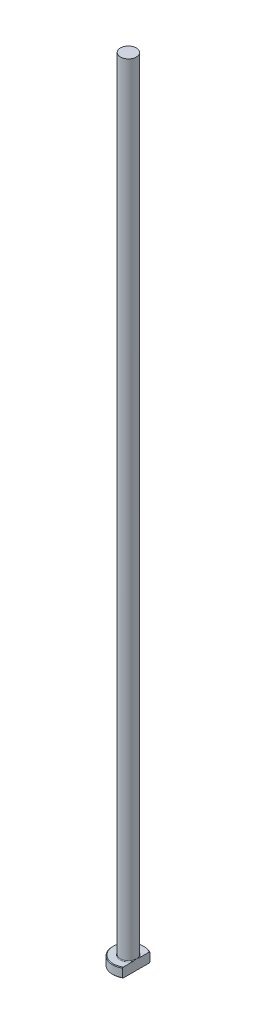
ISO-10303-21;
HEADER;
FILE_DESCRIPTION(('STEP AP214'),'2;1');
FILE_NAME('part.step','',(''),(''),'','','');
FILE_SCHEMA(('AUTOMOTIVE_DESIGN { 1 0 10303 214 1 1 1 1 }'));
ENDSEC;
DATA;
#1=APPLICATION_CONTEXT('core data for automotive mechanical design processes');
#2=APPLICATION_PROTOCOL_DEFINITION('international standard','automotive_design',2000,#1);
#3=PRODUCT_CONTEXT('',#1,'mechanical');
#4=PRODUCT('Part','Part','',(#3));
#5=PRODUCT_RELATED_PRODUCT_CATEGORY('part','',(#4));
#6=PRODUCT_DEFINITION_FORMATION('','',#4);
#7=PRODUCT_DEFINITION_CONTEXT('part definition',#1,'design');
#8=PRODUCT_DEFINITION('design','',#6,#7);
#9=PRODUCT_DEFINITION_SHAPE('','',#8);
#10=(LENGTH_UNIT() NAMED_UNIT(*) SI_UNIT(.MILLI.,.METRE.));
#11=(NAMED_UNIT(*) PLANE_ANGLE_UNIT() SI_UNIT($,.RADIAN.));
#12=(NAMED_UNIT(*) SI_UNIT($,.STERADIAN.) SOLID_ANGLE_UNIT());
#13=UNCERTAINTY_MEASURE_WITH_UNIT(LENGTH_MEASURE(1.E-05),#10,'distance_accuracy_value','');
#14=(GEOMETRIC_REPRESENTATION_CONTEXT(3) GLOBAL_UNCERTAINTY_ASSIGNED_CONTEXT((#13)) GLOBAL_UNIT_ASSIGNED_CONTEXT((#10,
#11,#12)) REPRESENTATION_CONTEXT('',''));
#15=CARTESIAN_POINT('',(0.,0.,0.));
#16=DIRECTION('',(0.,0.,1.));
#17=DIRECTION('',(1.,0.,0.));
#18=AXIS2_PLACEMENT_3D('',#15,#16,#17);
#19=CARTESIAN_POINT('',(0.,0.,0.));
#20=DIRECTION('',(0.,-1.,0.));
#21=DIRECTION('',(0.,0.,-1.));
#22=AXIS2_PLACEMENT_3D('',#19,#20,#21);
#23=PLANE('',#22);
#24=CARTESIAN_POINT('',(0.,0.,0.));
#25=DIRECTION('',(0.,-1.,0.));
#26=DIRECTION('',(0.,0.,-1.));
#27=AXIS2_PLACEMENT_3D('',#24,#25,#26);
#28=CIRCLE('',#27,4.79999999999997);
#29=CARTESIAN_POINT('',(2.49999999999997,0.,4.09756024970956));
#30=VERTEX_POINT('',#29);
#31=CARTESIAN_POINT('',(2.49999999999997,0.,-4.09756024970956));
#32=VERTEX_POINT('',#31);
#33=EDGE_CURVE('E98',#30,#32,#28,.T.);
#34=ORIENTED_EDGE('',*,*,#33,.T.);
#35=DIRECTION('',(0.,0.,1.));
#36=VECTOR('',#35,1.);
#37=CARTESIAN_POINT('',(2.49999999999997,0.,-4.33012701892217));
#38=LINE('',#37,#36);
#39=EDGE_CURVE('E83',#32,#30,#38,.T.);
#40=ORIENTED_EDGE('',*,*,#39,.T.);
#41=EDGE_LOOP('',(#34,#40));
#42=FACE_BOUND('',#41,.T.);
#43=ADVANCED_FACE('F32',(#42),#23,.T.);
#44=CARTESIAN_POINT('',(0.,259.958771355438,0.));
#45=DIRECTION('',(0.,1.,0.));
#46=DIRECTION('',(0.,0.,1.));
#47=AXIS2_PLACEMENT_3D('',#44,#45,#46);
#48=CYLINDRICAL_SURFACE('',#47,4.99999999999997);
#49=CARTESIAN_POINT('',(0.,2.79999999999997,0.));
#50=DIRECTION('',(0.,1.,0.));
#51=DIRECTION('',(0.,0.,1.));
#52=AXIS2_PLACEMENT_3D('',#49,#50,#51);
#53=CIRCLE('',#52,4.99999999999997);
#54=CARTESIAN_POINT('',(2.49999999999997,2.79999999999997,4.33012701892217));
#55=VERTEX_POINT('',#54);
#56=CARTESIAN_POINT('',(2.49999999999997,2.79999999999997,-4.33012701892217));
#57=VERTEX_POINT('',#56);
#58=EDGE_CURVE('E104',#55,#57,#53,.F.);
#59=ORIENTED_EDGE('',*,*,#58,.T.);
#60=DIRECTION('',(0.,-1.,0.));
#61=VECTOR('',#60,1.);
#62=CARTESIAN_POINT('',(2.49999999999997,250.,-4.33012701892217));
#63=LINE('',#62,#61);
#64=CARTESIAN_POINT('',(2.49999999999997,0.200000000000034,-4.33012701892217));
#65=VERTEX_POINT('',#64);
#66=EDGE_CURVE('E183',#57,#65,#63,.T.);
#67=ORIENTED_EDGE('',*,*,#66,.T.);
#68=CARTESIAN_POINT('',(0.,0.200000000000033,0.));
#69=DIRECTION('',(0.,-1.,0.));
#70=DIRECTION('',(0.,0.,-1.));
#71=AXIS2_PLACEMENT_3D('',#68,#69,#70);
#72=CIRCLE('',#71,4.99999999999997);
#73=CARTESIAN_POINT('',(2.49999999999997,0.200000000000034,4.33012701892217));
#74=VERTEX_POINT('',#73);
#75=EDGE_CURVE('E100',#65,#74,#72,.F.);
#76=ORIENTED_EDGE('',*,*,#75,.T.);
#77=DIRECTION('',(0.,-1.,0.));
#78=VECTOR('',#77,1.);
#79=CARTESIAN_POINT('',(2.49999999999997,250.,4.33012701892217));
#80=LINE('',#79,#78);
#81=EDGE_CURVE('E93',#55,#74,#80,.T.);
#82=ORIENTED_EDGE('',*,*,#81,.F.);
#83=EDGE_LOOP('',(#59,#67,#76,#82));
#84=FACE_BOUND('',#83,.T.);
#85=ADVANCED_FACE('F158',(#84),#48,.T.);
#86=CARTESIAN_POINT('',(-4.99999999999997,3.,0.));
#87=DIRECTION('',(0.,1.,0.));
#88=DIRECTION('',(0.,0.,1.));
#89=AXIS2_PLACEMENT_3D('',#86,#87,#88);
#90=PLANE('',#89);
#91=CARTESIAN_POINT('',(0.,3.,0.));
#92=DIRECTION('',(0.,1.,0.));
#93=DIRECTION('',(0.,0.,1.));
#94=AXIS2_PLACEMENT_3D('',#91,#92,#93);
#95=CIRCLE('',#94,4.79999999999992);
#96=CARTESIAN_POINT('',(2.49999999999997,3.,-4.0975602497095));
#97=VERTEX_POINT('',#96);
#98=CARTESIAN_POINT('',(2.49999999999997,3.,4.0975602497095));
#99=VERTEX_POINT('',#98);
#100=EDGE_CURVE('E178',#97,#99,#95,.T.);
#101=ORIENTED_EDGE('',*,*,#100,.T.);
#102=DIRECTION('',(0.,0.,-1.));
#103=VECTOR('',#102,1.);
#104=CARTESIAN_POINT('',(2.49999999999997,3.,0.));
#105=LINE('',#104,#103);
#106=CARTESIAN_POINT('',(2.49999999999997,2.99999999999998,1.01980390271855));
#107=VERTEX_POINT('',#106);
#108=EDGE_CURVE('E57',#99,#107,#105,.T.);
#109=ORIENTED_EDGE('',*,*,#108,.T.);
#110=CARTESIAN_POINT('',(0.,3.,0.));
#111=DIRECTION('',(0.,1.,0.));
#112=DIRECTION('',(0.,0.,1.));
#113=AXIS2_PLACEMENT_3D('',#110,#111,#112);
#114=CIRCLE('',#113,2.69999999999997);
#115=CARTESIAN_POINT('',(2.49999999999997,2.99999999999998,-1.01980390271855));
#116=VERTEX_POINT('',#115);
#117=EDGE_CURVE('E107',#107,#116,#114,.F.);
#118=ORIENTED_EDGE('',*,*,#117,.T.);
#119=EDGE_CURVE('E136',#116,#97,#105,.T.);
#120=ORIENTED_EDGE('',*,*,#119,.T.);
#121=EDGE_LOOP('',(#101,#109,#118,#120));
#122=FACE_BOUND('',#121,.T.);
#123=ADVANCED_FACE('F147',(#122),#90,.T.);
#124=CARTESIAN_POINT('',(0.,3.,0.));
#125=DIRECTION('',(0.,-1.,0.));
#126=DIRECTION('',(0.,0.,-1.));
#127=AXIS2_PLACEMENT_3D('',#124,#125,#126);
#128=CONICAL_SURFACE('',#127,4.79999999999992,0.785398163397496);
#129=ORIENTED_EDGE('',*,*,#58,.F.);
#130=CARTESIAN_POINT('',(2.49999999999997,-2.05039133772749,9.52786489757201));
#131=CARTESIAN_POINT('',(2.49999999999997,-1.8416036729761,9.31199733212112));
#132=CARTESIAN_POINT('',(2.49999999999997,-1.63304008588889,9.09591231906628));
#133=CARTESIAN_POINT('',(2.49999999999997,-1.21649358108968,8.66317810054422));
#134=CARTESIAN_POINT('',(2.49999999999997,-1.0085106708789,8.44652888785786));
#135=CARTESIAN_POINT('',(2.49999999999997,-0.593157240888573,8.01243155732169));
#136=CARTESIAN_POINT('',(2.49999999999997,-0.385787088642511,7.79498308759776));
#137=CARTESIAN_POINT('',(2.49999999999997,0.0280365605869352,7.3592177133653));
#138=CARTESIAN_POINT('',(2.49999999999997,0.234490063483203,7.14090081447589));
#139=CARTESIAN_POINT('',(2.49999999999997,0.642130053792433,6.70748960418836));
#140=CARTESIAN_POINT('',(2.49999999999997,0.8433398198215,6.49241720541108));
#141=CARTESIAN_POINT('',(2.49999999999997,1.2442538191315,6.06087422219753));
#142=CARTESIAN_POINT('',(2.49999999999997,1.44395806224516,5.84440364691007));
#143=CARTESIAN_POINT('',(2.49999999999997,1.84127751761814,5.40963663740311));
#144=CARTESIAN_POINT('',(2.49999999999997,2.03889317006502,5.19134060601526));
#145=CARTESIAN_POINT('',(2.49999999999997,2.43125043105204,4.75218509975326));
#146=CARTESIAN_POINT('',(2.49999999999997,2.62599215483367,4.53132572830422));
#147=CARTESIAN_POINT('',(2.49999999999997,2.93693788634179,4.17181619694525));
#148=CARTESIAN_POINT('',(2.49999999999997,3.05446493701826,4.03431188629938));
#149=CARTESIAN_POINT('',(2.49999999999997,3.28742704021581,3.7575148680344));
#150=CARTESIAN_POINT('',(2.49999999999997,3.40286188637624,3.618221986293));
#151=CARTESIAN_POINT('',(2.49999999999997,3.632132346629,3.3358649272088));
#152=CARTESIAN_POINT('',(2.49999999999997,3.74593818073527,3.1927764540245));
#153=CARTESIAN_POINT('',(2.49999999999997,3.96956266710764,2.90356071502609));
#154=CARTESIAN_POINT('',(2.49999999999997,4.0793822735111,2.75743418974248));
#155=CARTESIAN_POINT('',(2.49999999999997,4.29502410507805,2.45881038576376));
#156=CARTESIAN_POINT('',(2.49999999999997,4.40076032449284,2.30625006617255));
#157=CARTESIAN_POINT('',(2.49999999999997,4.55286945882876,2.07299325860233));
#158=CARTESIAN_POINT('',(2.49999999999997,4.60252613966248,1.9944419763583));
#159=CARTESIAN_POINT('',(2.49999999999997,4.69908164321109,1.83566827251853));
#160=CARTESIAN_POINT('',(2.49999999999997,4.74598077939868,1.75544604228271));
#161=CARTESIAN_POINT('',(2.49999999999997,4.83578466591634,1.59405362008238));
#162=CARTESIAN_POINT('',(2.49999999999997,4.87873126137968,1.5129070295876));
#163=CARTESIAN_POINT('',(2.49999999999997,4.96038600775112,1.34852090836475));
#164=CARTESIAN_POINT('',(2.49999999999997,4.99909338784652,1.26528100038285));
#165=CARTESIAN_POINT('',(2.49999999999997,5.10703093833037,1.01251774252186));
#166=CARTESIAN_POINT('',(2.49999999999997,5.16843307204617,0.839342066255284));
#167=CARTESIAN_POINT('',(2.49999999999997,5.23490554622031,0.579703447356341));
#168=CARTESIAN_POINT('',(2.49999999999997,5.25253806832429,0.496421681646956));
#169=CARTESIAN_POINT('',(2.49999999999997,5.27986337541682,0.328535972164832));
#170=CARTESIAN_POINT('',(2.49999999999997,5.2895568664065,0.243932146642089));
#171=CARTESIAN_POINT('',(2.49999999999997,5.30031768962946,0.0744340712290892));
#172=CARTESIAN_POINT('',(2.49999999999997,5.30141176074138,-0.0104584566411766));
#173=CARTESIAN_POINT('',(2.49999999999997,5.29496530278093,-0.179916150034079));
#174=CARTESIAN_POINT('',(2.49999999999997,5.28742406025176,-0.264481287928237));
#175=CARTESIAN_POINT('',(2.49999999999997,5.26433424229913,-0.431754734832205));
#176=CARTESIAN_POINT('',(2.49999999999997,5.24885436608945,-0.514472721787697));
#177=CARTESIAN_POINT('',(2.49999999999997,5.21085318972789,-0.678257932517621));
#178=CARTESIAN_POINT('',(2.49999999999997,5.18833104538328,-0.759324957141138));
#179=CARTESIAN_POINT('',(2.49999999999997,5.13718929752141,-0.920001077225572));
#180=CARTESIAN_POINT('',(2.49999999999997,5.1085353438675,-0.999599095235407));
#181=CARTESIAN_POINT('',(2.49999999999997,5.04628092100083,-1.15679278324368));
#182=CARTESIAN_POINT('',(2.49999999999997,5.01268146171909,-1.23438885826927));
#183=CARTESIAN_POINT('',(2.49999999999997,4.90558195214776,-1.46503672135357));
#184=CARTESIAN_POINT('',(2.49999999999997,4.82601567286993,-1.61526350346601));
#185=CARTESIAN_POINT('',(2.49999999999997,4.65635232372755,-1.90970759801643));
#186=CARTESIAN_POINT('',(2.49999999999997,4.56624199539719,-2.05391702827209));
#187=CARTESIAN_POINT('',(2.49999999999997,4.37862201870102,-2.33821627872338));
#188=CARTESIAN_POINT('',(2.49999999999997,4.28108460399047,-2.47828761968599));
#189=CARTESIAN_POINT('',(2.49999999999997,4.08116271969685,-2.75478641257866));
#190=CARTESIAN_POINT('',(2.49999999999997,3.97878070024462,-2.8912156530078));
#191=CARTESIAN_POINT('',(2.49999999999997,3.76913910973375,-3.16313520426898));
#192=CARTESIAN_POINT('',(2.49999999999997,3.66183307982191,-3.29858952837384));
#193=CARTESIAN_POINT('',(2.49999999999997,3.44456217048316,-3.56736427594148));
#194=CARTESIAN_POINT('',(2.49999999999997,3.33459700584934,-3.70068446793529));
#195=CARTESIAN_POINT('',(2.49999999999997,3.11293465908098,-3.96532340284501));
#196=CARTESIAN_POINT('',(2.49999999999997,3.00124232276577,-4.09664621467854));
#197=CARTESIAN_POINT('',(2.49999999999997,2.77631276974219,-4.35796341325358));
#198=CARTESIAN_POINT('',(2.49999999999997,2.66307552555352,-4.48795777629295));
#199=CARTESIAN_POINT('',(2.49999999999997,2.36028773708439,-4.83228553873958));
#200=CARTESIAN_POINT('',(2.49999999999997,2.16967435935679,-5.04568363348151));
#201=CARTESIAN_POINT('',(2.49999999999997,1.78611780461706,-5.47037913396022));
#202=CARTESIAN_POINT('',(2.49999999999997,1.59317456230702,-5.68167648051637));
#203=CARTESIAN_POINT('',(2.49999999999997,1.20540648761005,-6.10290357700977));
#204=CARTESIAN_POINT('',(2.49999999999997,1.0105800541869,-6.31283185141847));
#205=CARTESIAN_POINT('',(2.49999999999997,0.619649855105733,-6.73149551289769));
#206=CARTESIAN_POINT('',(2.49999999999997,0.423546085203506,-6.94023089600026));
#207=CARTESIAN_POINT('',(2.49999999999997,0.0384434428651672,-7.34820392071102));
#208=CARTESIAN_POINT('',(2.49999999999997,-0.150515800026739,-7.54747899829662));
#209=CARTESIAN_POINT('',(2.49999999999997,-0.529153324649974,-7.94534601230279));
#210=CARTESIAN_POINT('',(2.49999999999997,-0.718831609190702,-8.14393794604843));
#211=CARTESIAN_POINT('',(2.49999999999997,-1.09855461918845,-8.54034636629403));
#212=CARTESIAN_POINT('',(2.49999999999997,-1.28859869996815,-8.73816347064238));
#213=CARTESIAN_POINT('',(2.49999999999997,-1.66916268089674,-9.13333639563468));
#214=CARTESIAN_POINT('',(2.49999999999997,-1.85968257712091,-9.33069222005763));
#215=CARTESIAN_POINT('',(2.49999999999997,-2.05039133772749,-9.52786489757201));
#216=B_SPLINE_CURVE_WITH_KNOTS('',3,(#130,#131,#132,#133,#134,#135,#136,#137,#138,#139,#140,
#141,#142,#143,#144,#145,#146,#147,#148,#149,#150,#151,#152,#153,#154,#155,#156,#157,#158,#159,
#160,#161,#162,#163,#164,#165,#166,#167,#168,#169,#170,#171,#172,#173,#174,#175,#176,#177,#178,
#179,#180,#181,#182,#183,#184,#185,#186,#187,#188,#189,#190,#191,#192,#193,#194,#195,#196,#197,
#198,#199,#200,#201,#202,#203,#204,#205,#206,#207,#208,#209,#210,#211,#212,#213,#214,#215),
.UNSPECIFIED.,.F.,.F.,(4,2,2,2,2,2,2,2,2,2,2,2,2,2,2,2,2,2,2,2,2,2,2,2,2,2,2,2,2,2,2,2,2,2,2,2,
2,2,2,2,2,2,4),(0.,0.900955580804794,1.8019227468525,2.70335062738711,3.60477268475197,
4.48832484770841,5.37187123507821,6.25522753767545,7.13854832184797,7.68119321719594,
8.22389134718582,8.77232299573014,9.3206224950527,9.87724663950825,10.1559936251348,
10.4347088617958,10.7100145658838,10.9853702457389,11.5339745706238,11.7890461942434,
12.0440951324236,12.2983507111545,12.5526272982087,12.8047396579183,13.0568822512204,
13.310476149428,13.5640183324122,14.0732618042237,14.5831526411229,15.0950533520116,
15.6066978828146,16.1250759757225,16.643509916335,17.1606868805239,17.6778730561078,
18.5362451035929,19.3946412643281,20.2538459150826,21.113053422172,21.9369112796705,
22.7607723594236,23.583714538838,24.4066499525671),.UNSPECIFIED.);
#217=EDGE_CURVE('E135',#55,#99,#216,.T.);
#218=ORIENTED_EDGE('',*,*,#217,.T.);
#219=ORIENTED_EDGE('',*,*,#100,.F.);
#220=EDGE_CURVE('E127',#97,#57,#216,.T.);
#221=ORIENTED_EDGE('',*,*,#220,.T.);
#222=EDGE_LOOP('',(#129,#218,#219,#221));
#223=FACE_BOUND('',#222,.T.);
#224=ADVANCED_FACE('F143',(#223),#128,.T.);
#225=CARTESIAN_POINT('',(0.,0.200000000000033,0.));
#226=DIRECTION('',(0.,1.,0.));
#227=DIRECTION('',(0.,0.,1.));
#228=AXIS2_PLACEMENT_3D('',#225,#226,#227);
#229=CONICAL_SURFACE('',#228,4.99999999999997,0.785398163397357);
#230=ORIENTED_EDGE('',*,*,#75,.F.);
#231=CARTESIAN_POINT('',(2.49999999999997,5.05039133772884,-9.52786489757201));
#232=CARTESIAN_POINT('',(2.49999999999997,4.84160367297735,-9.31199733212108));
#233=CARTESIAN_POINT('',(2.49999999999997,4.63304008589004,-9.0959123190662));
#234=CARTESIAN_POINT('',(2.49999999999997,4.21649358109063,-8.66317810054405));
#235=CARTESIAN_POINT('',(2.49999999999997,4.00851067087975,-8.44652888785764));
#236=CARTESIAN_POINT('',(2.49999999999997,3.59315724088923,-8.01243155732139));
#237=CARTESIAN_POINT('',(2.49999999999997,3.38578708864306,-7.79498308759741));
#238=CARTESIAN_POINT('',(2.49999999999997,2.97196343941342,-7.35921771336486));
#239=CARTESIAN_POINT('',(2.49999999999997,2.76550993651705,-7.1409008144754));
#240=CARTESIAN_POINT('',(2.49999999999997,2.35786994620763,-6.70748960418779));
#241=CARTESIAN_POINT('',(2.49999999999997,2.15666018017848,-6.49241720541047));
#242=CARTESIAN_POINT('',(2.49999999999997,1.7557461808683,-6.06087422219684));
#243=CARTESIAN_POINT('',(2.49999999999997,1.55604193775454,-5.84440364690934));
#244=CARTESIAN_POINT('',(2.49999999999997,1.15872248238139,-5.4096366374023));
#245=CARTESIAN_POINT('',(2.49999999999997,0.961106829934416,-5.1913406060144));
#246=CARTESIAN_POINT('',(2.49999999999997,0.568749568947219,-4.7521850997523));
#247=CARTESIAN_POINT('',(2.49999999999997,0.374007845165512,-4.53132572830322));
#248=CARTESIAN_POINT('',(2.49999999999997,0.0630621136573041,-4.17181619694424));
#249=CARTESIAN_POINT('',(2.49999999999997,-0.0544649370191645,-4.0343118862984));
#250=CARTESIAN_POINT('',(2.49999999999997,-0.287427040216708,-3.75751486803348));
#251=CARTESIAN_POINT('',(2.49999999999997,-0.40286188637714,-3.61822198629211));
#252=CARTESIAN_POINT('',(2.49999999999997,-0.632132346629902,-3.33586492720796));
#253=CARTESIAN_POINT('',(2.49999999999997,-0.745938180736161,-3.19277645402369));
#254=CARTESIAN_POINT('',(2.49999999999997,-0.969562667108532,-2.90356071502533));
#255=CARTESIAN_POINT('',(2.49999999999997,-1.07938227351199,-2.75743418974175));
#256=CARTESIAN_POINT('',(2.49999999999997,-1.29502410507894,-2.45881038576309));
#257=CARTESIAN_POINT('',(2.49999999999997,-1.40076032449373,-2.3062500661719));
#258=CARTESIAN_POINT('',(2.49999999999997,-1.55286945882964,-2.07299325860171));
#259=CARTESIAN_POINT('',(2.49999999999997,-1.60252613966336,-1.99444197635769));
#260=CARTESIAN_POINT('',(2.49999999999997,-1.69908164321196,-1.83566827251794));
#261=CARTESIAN_POINT('',(2.49999999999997,-1.74598077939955,-1.75544604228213));
#262=CARTESIAN_POINT('',(2.49999999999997,-1.8357846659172,-1.59405362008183));
#263=CARTESIAN_POINT('',(2.49999999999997,-1.87873126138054,-1.51290702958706));
#264=CARTESIAN_POINT('',(2.49999999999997,-1.96038600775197,-1.34852090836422));
#265=CARTESIAN_POINT('',(2.49999999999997,-1.99909338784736,-1.26528100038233));
#266=CARTESIAN_POINT('',(2.49999999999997,-2.10703093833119,-1.01251774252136));
#267=CARTESIAN_POINT('',(2.49999999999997,-2.16843307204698,-0.839342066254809));
#268=CARTESIAN_POINT('',(2.49999999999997,-2.23490554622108,-0.579703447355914));
#269=CARTESIAN_POINT('',(2.49999999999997,-2.25253806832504,-0.496421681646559));
#270=CARTESIAN_POINT('',(2.49999999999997,-2.27986337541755,-0.328535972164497));
#271=CARTESIAN_POINT('',(2.49999999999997,-2.28955686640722,-0.243932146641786));
#272=CARTESIAN_POINT('',(2.49999999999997,-2.30031768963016,-0.0744340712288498));
#273=CARTESIAN_POINT('',(2.49999999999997,-2.30141176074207,0.0104584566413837));
#274=CARTESIAN_POINT('',(2.49999999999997,-2.29496530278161,0.179916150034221));
#275=CARTESIAN_POINT('',(2.49999999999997,-2.28742406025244,0.264481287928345));
#276=CARTESIAN_POINT('',(2.49999999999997,-2.2643342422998,0.431754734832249));
#277=CARTESIAN_POINT('',(2.49999999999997,-2.24885436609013,0.514472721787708));
#278=CARTESIAN_POINT('',(2.49999999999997,-2.21085318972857,0.678257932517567));
#279=CARTESIAN_POINT('',(2.49999999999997,-2.18833104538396,0.759324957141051));
#280=CARTESIAN_POINT('',(2.49999999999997,-2.13718929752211,0.920001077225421));
#281=CARTESIAN_POINT('',(2.49999999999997,-2.10853534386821,0.999599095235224));
#282=CARTESIAN_POINT('',(2.49999999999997,-2.04628092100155,1.15679278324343));
#283=CARTESIAN_POINT('',(2.49999999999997,-2.01268146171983,1.23438885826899));
#284=CARTESIAN_POINT('',(2.49999999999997,-1.90558195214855,1.46503672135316));
#285=CARTESIAN_POINT('',(2.49999999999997,-1.82601567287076,1.61526350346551));
#286=CARTESIAN_POINT('',(2.49999999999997,-1.65635232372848,1.90970759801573));
#287=CARTESIAN_POINT('',(2.49999999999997,-1.56624199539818,2.05391702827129));
#288=CARTESIAN_POINT('',(2.49999999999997,-1.37862201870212,2.33821627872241));
#289=CARTESIAN_POINT('',(2.49999999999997,-1.28108460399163,2.47828761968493));
#290=CARTESIAN_POINT('',(2.49999999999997,-1.08116271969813,2.75478641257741));
#291=CARTESIAN_POINT('',(2.49999999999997,-0.978780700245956,2.89121565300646));
#292=CARTESIAN_POINT('',(2.49999999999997,-0.769139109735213,3.16313520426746));
#293=CARTESIAN_POINT('',(2.49999999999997,-0.661833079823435,3.29858952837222));
#294=CARTESIAN_POINT('',(2.49999999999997,-0.444562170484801,3.56736427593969));
#295=CARTESIAN_POINT('',(2.49999999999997,-0.334597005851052,3.70068446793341));
#296=CARTESIAN_POINT('',(2.49999999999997,-0.112934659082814,3.96532340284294));
#297=CARTESIAN_POINT('',(2.49999999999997,-0.00124232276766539,4.09664621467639));
#298=CARTESIAN_POINT('',(2.49999999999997,0.223687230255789,4.35796341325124));
#299=CARTESIAN_POINT('',(2.49999999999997,0.336924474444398,4.48795777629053));
#300=CARTESIAN_POINT('',(2.49999999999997,0.639712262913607,4.83228553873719));
#301=CARTESIAN_POINT('',(2.49999999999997,0.830325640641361,5.04568363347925));
#302=CARTESIAN_POINT('',(2.49999999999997,1.21388219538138,5.4703791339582));
#303=CARTESIAN_POINT('',(2.49999999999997,1.40682543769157,5.68167648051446));
#304=CARTESIAN_POINT('',(2.49999999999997,1.79459351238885,6.1029035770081));
#305=CARTESIAN_POINT('',(2.49999999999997,1.98941994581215,6.31283185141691));
#306=CARTESIAN_POINT('',(2.49999999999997,2.38035014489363,6.73149551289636));
#307=CARTESIAN_POINT('',(2.49999999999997,2.57645391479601,6.94023089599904));
#308=CARTESIAN_POINT('',(2.49999999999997,2.96155655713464,7.34820392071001));
#309=CARTESIAN_POINT('',(2.49999999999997,3.15051580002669,7.5474789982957));
#310=CARTESIAN_POINT('',(2.49999999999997,3.5291533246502,7.94534601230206));
#311=CARTESIAN_POINT('',(2.49999999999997,3.71883160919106,8.14393794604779));
#312=CARTESIAN_POINT('',(2.49999999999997,4.0985546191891,8.54034636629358));
#313=CARTESIAN_POINT('',(2.49999999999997,4.28859869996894,8.73816347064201));
#314=CARTESIAN_POINT('',(2.49999999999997,4.6691626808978,9.13333639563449));
#315=CARTESIAN_POINT('',(2.49999999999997,4.85968257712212,9.33069222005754));
#316=CARTESIAN_POINT('',(2.49999999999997,5.05039133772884,9.52786489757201));
#317=B_SPLINE_CURVE_WITH_KNOTS('',3,(#231,#232,#233,#234,#235,#236,#237,#238,#239,#240,#241,
#242,#243,#244,#245,#246,#247,#248,#249,#250,#251,#252,#253,#254,#255,#256,#257,#258,#259,#260,
#261,#262,#263,#264,#265,#266,#267,#268,#269,#270,#271,#272,#273,#274,#275,#276,#277,#278,#279,
#280,#281,#282,#283,#284,#285,#286,#287,#288,#289,#290,#291,#292,#293,#294,#295,#296,#297,#298,
#299,#300,#301,#302,#303,#304,#305,#306,#307,#308,#309,#310,#311,#312,#313,#314,#315,#316),
.UNSPECIFIED.,.F.,.F.,(4,2,2,2,2,2,2,2,2,2,2,2,2,2,2,2,2,2,2,2,2,2,2,2,2,2,2,2,2,2,2,2,2,2,2,2,
2,2,2,2,2,2,4),(0.,0.900955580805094,1.8019227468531,2.70335062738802,3.60477268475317,
4.48832484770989,5.37187123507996,6.25522753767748,7.13854832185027,7.68119321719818,
8.22389134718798,8.77232299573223,9.32062249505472,9.87724663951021,10.1559936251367,
10.4347088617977,10.7100145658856,10.9853702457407,11.5339745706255,11.789046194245,
12.0440951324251,12.298350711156,12.5526272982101,12.8047396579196,13.0568822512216,
13.3104761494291,13.5640183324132,14.0732618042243,14.5831526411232,15.0950533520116,
15.6066978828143,16.1250759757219,16.6435099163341,17.1606868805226,17.6778730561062,
18.5362451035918,19.3946412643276,20.2538459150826,21.1130534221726,21.9369112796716,
22.7607723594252,23.5837145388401,24.4066499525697),.UNSPECIFIED.);
#318=EDGE_CURVE('E86',#65,#32,#317,.T.);
#319=ORIENTED_EDGE('',*,*,#318,.T.);
#320=ORIENTED_EDGE('',*,*,#33,.F.);
#321=EDGE_CURVE('E89',#30,#74,#317,.T.);
#322=ORIENTED_EDGE('',*,*,#321,.T.);
#323=EDGE_LOOP('',(#230,#319,#320,#322));
#324=FACE_BOUND('',#323,.T.);
#325=ADVANCED_FACE('F97',(#324),#229,.T.);
#326=CARTESIAN_POINT('',(0.,3.19999999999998,0.));
#327=DIRECTION('',(0.,1.,0.));
#328=DIRECTION('',(0.,0.,1.));
#329=AXIS2_PLACEMENT_3D('',#326,#327,#328);
#330=TOROIDAL_SURFACE('',#329,2.69999999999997,0.2);
#331=CARTESIAN_POINT('',(2.49999999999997,3.19999999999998,0.));
#332=CARTESIAN_POINT('',(2.49999999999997,3.20000050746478,5.29061312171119E-11));
#333=CARTESIAN_POINT('',(2.49999999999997,3.20000101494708,-1.70517157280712E-07));
#334=CARTESIAN_POINT('',(2.49999999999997,3.20000196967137,-6.59443804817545E-07));
#335=CARTESIAN_POINT('',(2.49999999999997,3.20000240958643,-9.87883924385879E-07));
#336=CARTESIAN_POINT('',(2.49999999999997,3.20000331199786,-1.7724689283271E-06));
#337=CARTESIAN_POINT('',(2.49999999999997,3.20000376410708,-2.24097229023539E-06));
#338=CARTESIAN_POINT('',(2.49999999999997,3.20000458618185,-3.2218605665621E-06));
#339=CARTESIAN_POINT('',(2.49999999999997,3.20000495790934,-3.73286586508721E-06));
#340=CARTESIAN_POINT('',(2.49999999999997,3.20000630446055,-5.67453781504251E-06));
#341=CARTESIAN_POINT('',(2.49999999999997,3.20000720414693,-7.15943624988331E-06));
#342=CARTESIAN_POINT('',(2.49999999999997,3.20000871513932,-1.01304383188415E-05));
#343=CARTESIAN_POINT('',(2.49999999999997,3.20000934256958,-1.16087237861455E-05));
#344=CARTESIAN_POINT('',(2.49999999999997,3.20001191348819,-1.77555555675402E-05));
#345=CARTESIAN_POINT('',(2.49999999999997,3.20001378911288,-2.24564506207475E-05));
#346=CARTESIAN_POINT('',(2.49999999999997,3.20001661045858,-3.14167101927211E-05));
#347=CARTESIAN_POINT('',(2.49999999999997,3.20001764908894,-3.56468503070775E-05));
#348=CARTESIAN_POINT('',(2.49999999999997,3.20002511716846,-6.67543462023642E-05));
#349=CARTESIAN_POINT('',(2.49999999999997,3.20003067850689,-9.37930225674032E-05));
#350=CARTESIAN_POINT('',(2.49999999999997,3.20005501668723,-0.000200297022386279));
#351=CARTESIAN_POINT('',(2.49999999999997,3.20007833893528,-0.000278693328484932));
#352=CARTESIAN_POINT('',(2.49999999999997,3.20016883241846,-0.000588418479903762));
#353=CARTESIAN_POINT('',(2.49999999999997,3.2002329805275,-0.000820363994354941));
#354=CARTESIAN_POINT('',(2.49999999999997,3.20048923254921,-0.00173961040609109));
#355=CARTESIAN_POINT('',(2.49999999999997,3.20068508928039,-0.00242612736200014));
#356=CARTESIAN_POINT('',(2.49999999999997,3.201497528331,-0.00528196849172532));
#357=CARTESIAN_POINT('',(2.49999999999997,3.20210941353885,-0.0074522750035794));
#358=CARTESIAN_POINT('',(2.49999999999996,3.20774599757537,-0.0274346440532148));
#359=CARTESIAN_POINT('',(2.49999999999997,3.21279017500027,-0.0452427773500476));
#360=CARTESIAN_POINT('',(2.49999999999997,3.22264347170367,-0.080167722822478));
#361=CARTESIAN_POINT('',(2.49999999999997,3.22745402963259,-0.0972841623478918));
#362=CARTESIAN_POINT('',(2.49999999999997,3.23763483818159,-0.133672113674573));
#363=CARTESIAN_POINT('',(2.49999999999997,3.24299975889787,-0.15294514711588));
#364=CARTESIAN_POINT('',(2.49999999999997,3.25370389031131,-0.191722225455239));
#365=CARTESIAN_POINT('',(2.49999999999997,3.25904219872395,-0.211226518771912));
#366=CARTESIAN_POINT('',(2.49999999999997,3.27184445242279,-0.258540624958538));
#367=CARTESIAN_POINT('',(2.49999999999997,3.27925018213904,-0.286366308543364));
#368=CARTESIAN_POINT('',(2.49999999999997,3.29355148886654,-0.341371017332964));
#369=CARTESIAN_POINT('',(2.49999999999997,3.30045534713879,-0.368547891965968));
#370=CARTESIAN_POINT('',(2.49999999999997,3.31991129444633,-0.447507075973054));
#371=CARTESIAN_POINT('',(2.49999999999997,3.33195369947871,-0.499417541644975));
#372=CARTESIAN_POINT('',(2.49999999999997,3.35404241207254,-0.60418810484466));
#373=CARTESIAN_POINT('',(2.49999999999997,3.36406867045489,-0.657052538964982));
#374=CARTESIAN_POINT('',(2.49999999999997,3.38176575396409,-0.767598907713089));
#375=CARTESIAN_POINT('',(2.49999999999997,3.38917909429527,-0.825323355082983));
#376=CARTESIAN_POINT('',(2.49999999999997,3.39884096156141,-0.94105511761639));
#377=CARTESIAN_POINT('',(2.49999999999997,3.40111055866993,-0.999060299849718));
#378=CARTESIAN_POINT('',(2.49999999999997,3.39847691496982,-1.09324578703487));
#379=CARTESIAN_POINT('',(2.49999999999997,3.39593644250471,-1.12948454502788));
#380=CARTESIAN_POINT('',(2.49999999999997,3.38674319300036,-1.20096926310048));
#381=CARTESIAN_POINT('',(2.49999999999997,3.38015410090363,-1.2362219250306));
#382=CARTESIAN_POINT('',(2.49999999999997,3.36639936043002,-1.28579148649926));
#383=CARTESIAN_POINT('',(2.49999999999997,3.36162670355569,-1.30076836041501));
#384=CARTESIAN_POINT('',(2.49999999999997,3.35062798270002,-1.33028325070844));
#385=CARTESIAN_POINT('',(2.49999999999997,3.34439458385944,-1.34481861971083));
#386=CARTESIAN_POINT('',(2.49999999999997,3.33003808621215,-1.37319413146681));
#387=CARTESIAN_POINT('',(2.49999999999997,3.32189015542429,-1.38702194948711));
#388=CARTESIAN_POINT('',(2.49999999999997,3.30325367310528,-1.4129811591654));
#389=CARTESIAN_POINT('',(2.49999999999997,3.2927824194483,-1.42512406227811));
#390=CARTESIAN_POINT('',(2.49999999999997,3.27569207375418,-1.44029611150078));
#391=CARTESIAN_POINT('',(2.49999999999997,3.27021837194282,-1.4446101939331));
#392=CARTESIAN_POINT('',(2.49999999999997,3.25870897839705,-1.45242709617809));
#393=CARTESIAN_POINT('',(2.49999999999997,3.25267333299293,-1.45592998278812));
#394=CARTESIAN_POINT('',(2.49999999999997,3.24001938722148,-1.46191450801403));
#395=CARTESIAN_POINT('',(2.49999999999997,3.233395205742,-1.46438399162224));
#396=CARTESIAN_POINT('',(2.49999999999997,3.21979347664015,-1.46798853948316));
#397=CARTESIAN_POINT('',(2.49999999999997,3.21281651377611,-1.46912574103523));
#398=CARTESIAN_POINT('',(2.49999999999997,3.19961348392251,-1.46988240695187));
#399=CARTESIAN_POINT('',(2.49999999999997,3.19339654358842,-1.46966594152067));
#400=CARTESIAN_POINT('',(2.49999999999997,3.18110362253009,-1.46811597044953));
#401=CARTESIAN_POINT('',(2.49999999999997,3.17502769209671,-1.46678207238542));
#402=CARTESIAN_POINT('',(2.49999999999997,3.16354702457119,-1.46323301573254));
#403=CARTESIAN_POINT('',(2.49999999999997,3.15812390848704,-1.46107586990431));
#404=CARTESIAN_POINT('',(2.49999999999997,3.14763458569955,-1.45603007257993));
#405=CARTESIAN_POINT('',(2.49999999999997,3.14256845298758,-1.45314127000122));
#406=CARTESIAN_POINT('',(2.49999999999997,3.12963191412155,-1.44468844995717));
#407=CARTESIAN_POINT('',(2.49999999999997,3.12209714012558,-1.43861122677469));
#408=CARTESIAN_POINT('',(2.49999999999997,3.10805350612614,-1.42536327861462));
#409=CARTESIAN_POINT('',(2.49999999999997,3.10154826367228,-1.418188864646));
#410=CARTESIAN_POINT('',(2.49999999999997,3.08513615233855,-1.39772885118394));
#411=CARTESIAN_POINT('',(2.49999999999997,3.07611692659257,-1.38373739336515));
#412=CARTESIAN_POINT('',(2.49999999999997,3.06018433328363,-1.35465370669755));
#413=CARTESIAN_POINT('',(2.49999999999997,3.0532724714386,-1.33956070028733));
#414=CARTESIAN_POINT('',(2.49999999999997,3.04107204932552,-1.30868385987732));
#415=CARTESIAN_POINT('',(2.49999999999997,3.03578911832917,-1.29289784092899));
#416=CARTESIAN_POINT('',(2.49999999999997,3.02655583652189,-1.26093375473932));
#417=CARTESIAN_POINT('',(2.49999999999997,3.0226069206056,-1.24475528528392));
#418=CARTESIAN_POINT('',(2.49999999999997,3.01232854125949,-1.19551094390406));
#419=CARTESIAN_POINT('',(2.49999999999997,3.00769429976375,-1.16209442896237));
#420=CARTESIAN_POINT('',(2.49999999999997,3.00005311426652,-1.07761506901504));
#421=CARTESIAN_POINT('',(2.49999999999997,2.99913690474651,-1.02638928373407));
#422=CARTESIAN_POINT('',(2.49999999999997,3.00223345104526,-0.923947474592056));
#423=CARTESIAN_POINT('',(2.49999999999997,3.00626667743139,-0.872732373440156));
#424=CARTESIAN_POINT('',(2.49999999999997,3.01749958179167,-0.773934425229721));
#425=CARTESIAN_POINT('',(2.49999999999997,3.02448410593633,-0.72632575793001));
#426=CARTESIAN_POINT('',(2.49999999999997,3.04066526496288,-0.631906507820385));
#427=CARTESIAN_POINT('',(2.49999999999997,3.0498429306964,-0.585092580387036));
#428=CARTESIAN_POINT('',(2.49999999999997,3.06791405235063,-0.500780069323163));
#429=CARTESIAN_POINT('',(2.49999999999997,3.07652349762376,-0.463219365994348));
#430=CARTESIAN_POINT('',(2.49999999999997,3.09478102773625,-0.387318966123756));
#431=CARTESIAN_POINT('',(2.49999999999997,3.10445029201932,-0.348984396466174));
#432=CARTESIAN_POINT('',(2.49999999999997,3.12135487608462,-0.284095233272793));
#433=CARTESIAN_POINT('',(2.49999999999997,3.12843710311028,-0.257500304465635));
#434=CARTESIAN_POINT('',(2.49999999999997,3.14273562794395,-0.204655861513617));
#435=CARTESIAN_POINT('',(2.49999999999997,3.1499496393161,-0.178405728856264));
#436=CARTESIAN_POINT('',(2.49999999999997,3.1636921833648,-0.128877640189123));
#437=CARTESIAN_POINT('',(2.49999999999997,3.17020707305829,-0.10559584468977));
#438=CARTESIAN_POINT('',(2.49999999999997,3.18358099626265,-0.0580847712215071));
#439=CARTESIAN_POINT('',(2.49999999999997,3.19044308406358,-0.033856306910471));
#440=CARTESIAN_POINT('',(2.49999999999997,3.19789108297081,-0.00745034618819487));
#441=CARTESIAN_POINT('',(2.49999999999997,3.198503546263,-0.00527812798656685));
#442=CARTESIAN_POINT('',(2.49999999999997,3.1993161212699,-0.0024218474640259));
#443=CARTESIAN_POINT('',(2.49999999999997,3.19951155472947,-0.00173680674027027));
#444=CARTESIAN_POINT('',(2.49999999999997,3.19976729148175,-0.000819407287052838));
#445=CARTESIAN_POINT('',(2.49999999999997,3.19983133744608,-0.00058783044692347));
#446=CARTESIAN_POINT('',(2.49999999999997,3.19992170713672,-0.000278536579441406));
#447=CARTESIAN_POINT('',(2.49999999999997,3.19994501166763,-0.000200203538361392));
#448=CARTESIAN_POINT('',(2.49999999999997,3.19996933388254,-9.3772760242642E-05));
#449=CARTESIAN_POINT('',(2.49999999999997,3.19997489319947,-6.67431741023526E-05));
#450=CARTESIAN_POINT('',(2.49999999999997,3.1999823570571,-3.56449049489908E-05));
#451=CARTESIAN_POINT('',(2.49999999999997,3.19998339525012,-3.14152905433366E-05));
#452=CARTESIAN_POINT('',(2.49999999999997,3.19998621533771,-2.24560901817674E-05));
#453=CARTESIAN_POINT('',(2.49999999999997,3.19998809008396,-1.77557009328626E-05));
#454=CARTESIAN_POINT('',(2.49999999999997,3.19999065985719,-1.16093871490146E-05));
#455=CARTESIAN_POINT('',(2.49999999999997,3.1999912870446,-1.01311410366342E-05));
#456=CARTESIAN_POINT('',(2.49999999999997,3.19999279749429,-7.16017592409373E-06));
#457=CARTESIAN_POINT('',(2.49999999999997,3.19999369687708,-5.67527054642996E-06));
#458=CARTESIAN_POINT('',(2.49999999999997,3.19999504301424,-3.73354014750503E-06));
#459=CARTESIAN_POINT('',(2.49999999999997,3.19999541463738,-3.22250653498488E-06));
#460=CARTESIAN_POINT('',(2.49999999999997,3.19999623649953,-2.24154280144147E-06));
#461=CARTESIAN_POINT('',(2.49999999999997,3.19999668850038,-1.77299174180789E-06));
#462=CARTESIAN_POINT('',(2.49999999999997,3.19999759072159,-9.88293774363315E-07));
#463=CARTESIAN_POINT('',(2.49999999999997,3.19999803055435,-6.59792278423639E-07));
#464=CARTESIAN_POINT('',(2.49999999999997,3.19999898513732,-1.7071215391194E-07));
#465=CARTESIAN_POINT('',(2.49999999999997,3.1999994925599,-5.29035539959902E-11));
#466=CARTESIAN_POINT('',(2.49999999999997,3.19999999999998,0.));
#467=B_SPLINE_CURVE_WITH_KNOTS('',3,(#331,#332,#333,#334,#335,#336,#337,#338,#339,#340,#341,
#342,#343,#344,#345,#346,#347,#348,#349,#350,#351,#352,#353,#354,#355,#356,#357,#358,#359,#360,
#361,#362,#363,#364,#365,#366,#367,#368,#369,#370,#371,#372,#373,#374,#375,#376,#377,#378,#379,
#380,#381,#382,#383,#384,#385,#386,#387,#388,#389,#390,#391,#392,#393,#394,#395,#396,#397,#398,
#399,#400,#401,#402,#403,#404,#405,#406,#407,#408,#409,#410,#411,#412,#413,#414,#415,#416,#417,
#418,#419,#420,#421,#422,#423,#424,#425,#426,#427,#428,#429,#430,#431,#432,#433,#434,#435,#436,
#437,#438,#439,#440,#441,#442,#443,#444,#445,#446,#447,#448,#449,#450,#451,#452,#453,#454,#455,
#456,#457,#458,#459,#460,#461,#462,#463,#464,#465,#466),.UNSPECIFIED.,.T.,.F.,(4,2,2,2,2,2,2,2,
2,2,2,2,2,2,2,2,2,2,2,2,2,2,2,2,2,2,2,2,2,2,2,2,2,2,2,2,2,2,2,2,2,2,2,2,2,2,2,2,2,2,2,2,2,2,2,2,
2,2,2,2,2,2,2,2,2,2,2,4),(0.,1.53002989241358E-06,3.17429895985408E-06,5.11692917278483E-06,
7.01128942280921E-06,1.21993179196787E-05,1.70129966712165E-05,3.21659460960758E-05,
4.52166487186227E-05,0.000128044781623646,0.000373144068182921,0.00109538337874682,
0.00323676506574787,0.0100018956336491,0.0655261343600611,0.118865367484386,0.178882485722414,
0.239547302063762,0.325928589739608,0.410047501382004,0.56988542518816,0.731241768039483,
0.905704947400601,1.07945217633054,1.18829443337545,1.2954669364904,1.34257193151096,
1.38991872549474,1.43791728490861,1.4855698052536,1.50642342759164,1.52727533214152,
1.54836603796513,1.56942286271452,1.58798129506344,1.60654624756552,1.62399133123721,
1.64144002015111,1.67031274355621,1.69928476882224,1.74894310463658,1.79863683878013,
1.84850042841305,1.8984174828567,1.99938099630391,2.1527113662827,2.30667804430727,
2.45095908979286,2.59403470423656,2.70962861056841,2.8282269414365,2.91079145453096,
2.99246070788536,3.06498967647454,3.14053132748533,3.14730244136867,3.14943921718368,
3.15016030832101,3.15040521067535,3.15048801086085,3.15050105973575,3.1505162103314,
3.15052102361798,3.15052621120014,3.1505281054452,3.15053004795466,3.15053169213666,
3.15053322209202),.UNSPECIFIED.);
#468=CARTESIAN_POINT('',(2.49999999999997,3.19999999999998,0.));
#469=VERTEX_POINT('',#468);
#470=EDGE_CURVE('E11',#116,#469,#467,.T.);
#471=ORIENTED_EDGE('',*,*,#470,.F.);
#472=ORIENTED_EDGE('',*,*,#117,.F.);
#473=CARTESIAN_POINT('',(2.49999999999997,3.19999999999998,0.));
#474=CARTESIAN_POINT('',(2.49999999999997,3.19999949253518,-5.29060891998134E-11));
#475=CARTESIAN_POINT('',(2.49999999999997,3.19999898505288,1.70517157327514E-07));
#476=CARTESIAN_POINT('',(2.49999999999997,3.19999803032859,6.59443804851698E-07));
#477=CARTESIAN_POINT('',(2.49999999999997,3.19999759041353,9.87883924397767E-07));
#478=CARTESIAN_POINT('',(2.49999999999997,3.19999668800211,1.77246892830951E-06));
#479=CARTESIAN_POINT('',(2.49999999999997,3.19999623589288,2.24097229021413E-06));
#480=CARTESIAN_POINT('',(2.49999999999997,3.19999541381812,3.22186056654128E-06));
#481=CARTESIAN_POINT('',(2.49999999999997,3.19999504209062,3.73286586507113E-06));
#482=CARTESIAN_POINT('',(2.49999999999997,3.19999369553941,5.67453781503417E-06));
#483=CARTESIAN_POINT('',(2.49999999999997,3.19999279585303,7.15943624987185E-06));
#484=CARTESIAN_POINT('',(2.49999999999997,3.19999128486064,1.01304383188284E-05));
#485=CARTESIAN_POINT('',(2.49999999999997,3.19999065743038,1.1608723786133E-05));
#486=CARTESIAN_POINT('',(2.49999999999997,3.19998808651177,1.77555555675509E-05));
#487=CARTESIAN_POINT('',(2.49999999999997,3.19998621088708,2.24564506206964E-05));
#488=CARTESIAN_POINT('',(2.49999999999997,3.19998338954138,3.14167101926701E-05));
#489=CARTESIAN_POINT('',(2.49999999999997,3.19998235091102,3.56468503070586E-05));
#490=CARTESIAN_POINT('',(2.49999999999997,3.19997488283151,6.67543462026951E-05));
#491=CARTESIAN_POINT('',(2.49999999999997,3.19996932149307,9.37930225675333E-05));
#492=CARTESIAN_POINT('',(2.49999999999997,3.19994498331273,0.000200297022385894));
#493=CARTESIAN_POINT('',(2.49999999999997,3.19992166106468,0.000278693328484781));
#494=CARTESIAN_POINT('',(2.49999999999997,3.1998311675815,0.000588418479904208));
#495=CARTESIAN_POINT('',(2.49999999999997,3.19976701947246,0.000820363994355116));
#496=CARTESIAN_POINT('',(2.49999999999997,3.19951076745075,0.00173961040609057));
#497=CARTESIAN_POINT('',(2.49999999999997,3.19931491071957,0.00242612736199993));
#498=CARTESIAN_POINT('',(2.49999999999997,3.19850247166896,0.00528196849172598));
#499=CARTESIAN_POINT('',(2.49999999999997,3.19789058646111,0.00745227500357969));
#500=CARTESIAN_POINT('',(2.49999999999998,3.19225400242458,0.0274346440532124));
#501=CARTESIAN_POINT('',(2.49999999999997,3.18720982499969,0.045242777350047));
#502=CARTESIAN_POINT('',(2.49999999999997,3.17735652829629,0.0801677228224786));
#503=CARTESIAN_POINT('',(2.49999999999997,3.17254597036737,0.0972841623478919));
#504=CARTESIAN_POINT('',(2.49999999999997,3.16236516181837,0.133672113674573));
#505=CARTESIAN_POINT('',(2.49999999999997,3.15700024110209,0.15294514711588));
#506=CARTESIAN_POINT('',(2.49999999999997,3.14629610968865,0.191722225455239));
#507=CARTESIAN_POINT('',(2.49999999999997,3.14095780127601,0.211226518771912));
#508=CARTESIAN_POINT('',(2.49999999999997,3.12815554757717,0.258540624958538));
#509=CARTESIAN_POINT('',(2.49999999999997,3.12074981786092,0.286366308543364));
#510=CARTESIAN_POINT('',(2.49999999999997,3.10644851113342,0.341371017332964));
#511=CARTESIAN_POINT('',(2.49999999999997,3.09954465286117,0.368547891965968));
#512=CARTESIAN_POINT('',(2.49999999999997,3.08008870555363,0.447507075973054));
#513=CARTESIAN_POINT('',(2.49999999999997,3.06804630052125,0.499417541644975));
#514=CARTESIAN_POINT('',(2.49999999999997,3.04595758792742,0.60418810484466));
#515=CARTESIAN_POINT('',(2.49999999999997,3.03593132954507,0.657052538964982));
#516=CARTESIAN_POINT('',(2.49999999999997,3.01823424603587,0.767598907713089));
#517=CARTESIAN_POINT('',(2.49999999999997,3.01082090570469,0.825323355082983));
#518=CARTESIAN_POINT('',(2.49999999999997,3.00115903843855,0.94105511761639));
#519=CARTESIAN_POINT('',(2.49999999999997,2.99888944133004,0.999060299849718));
#520=CARTESIAN_POINT('',(2.49999999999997,3.00152308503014,1.09324578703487));
#521=CARTESIAN_POINT('',(2.49999999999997,3.00406355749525,1.12948454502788));
#522=CARTESIAN_POINT('',(2.49999999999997,3.0132568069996,1.20096926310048));
#523=CARTESIAN_POINT('',(2.49999999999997,3.01984589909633,1.2362219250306));
#524=CARTESIAN_POINT('',(2.49999999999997,3.03360063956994,1.28579148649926));
#525=CARTESIAN_POINT('',(2.49999999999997,3.03837329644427,1.30076836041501));
#526=CARTESIAN_POINT('',(2.49999999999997,3.04937201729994,1.33028325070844));
#527=CARTESIAN_POINT('',(2.49999999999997,3.05560541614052,1.34481861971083));
#528=CARTESIAN_POINT('',(2.49999999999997,3.06996191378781,1.37319413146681));
#529=CARTESIAN_POINT('',(2.49999999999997,3.07810984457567,1.38702194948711));
#530=CARTESIAN_POINT('',(2.49999999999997,3.09674632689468,1.4129811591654));
#531=CARTESIAN_POINT('',(2.49999999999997,3.10721758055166,1.42512406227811));
#532=CARTESIAN_POINT('',(2.49999999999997,3.12430792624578,1.44029611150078));
#533=CARTESIAN_POINT('',(2.49999999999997,3.12978162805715,1.4446101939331));
#534=CARTESIAN_POINT('',(2.49999999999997,3.14129102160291,1.45242709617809));
#535=CARTESIAN_POINT('',(2.49999999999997,3.14732666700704,1.45592998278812));
#536=CARTESIAN_POINT('',(2.49999999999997,3.15998061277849,1.46191450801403));
#537=CARTESIAN_POINT('',(2.49999999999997,3.16660479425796,1.46438399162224));
#538=CARTESIAN_POINT('',(2.49999999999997,3.18020652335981,1.46798853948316));
#539=CARTESIAN_POINT('',(2.49999999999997,3.18718348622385,1.46912574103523));
#540=CARTESIAN_POINT('',(2.49999999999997,3.20038651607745,1.46988240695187));
#541=CARTESIAN_POINT('',(2.49999999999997,3.20660345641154,1.46966594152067));
#542=CARTESIAN_POINT('',(2.49999999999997,3.21889637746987,1.46811597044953));
#543=CARTESIAN_POINT('',(2.49999999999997,3.22497230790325,1.46678207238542));
#544=CARTESIAN_POINT('',(2.49999999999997,3.23645297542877,1.46323301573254));
#545=CARTESIAN_POINT('',(2.49999999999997,3.24187609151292,1.46107586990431));
#546=CARTESIAN_POINT('',(2.49999999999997,3.25236541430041,1.45603007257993));
#547=CARTESIAN_POINT('',(2.49999999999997,3.25743154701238,1.45314127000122));
#548=CARTESIAN_POINT('',(2.49999999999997,3.27036808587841,1.44468844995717));
#549=CARTESIAN_POINT('',(2.49999999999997,3.27790285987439,1.43861122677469));
#550=CARTESIAN_POINT('',(2.49999999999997,3.29194649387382,1.42536327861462));
#551=CARTESIAN_POINT('',(2.49999999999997,3.29845173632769,1.418188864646));
#552=CARTESIAN_POINT('',(2.49999999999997,3.31486384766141,1.39772885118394));
#553=CARTESIAN_POINT('',(2.49999999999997,3.3238830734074,1.38373739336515));
#554=CARTESIAN_POINT('',(2.49999999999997,3.33981566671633,1.35465370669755));
#555=CARTESIAN_POINT('',(2.49999999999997,3.34672752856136,1.33956070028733));
#556=CARTESIAN_POINT('',(2.49999999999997,3.35892795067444,1.30868385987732));
#557=CARTESIAN_POINT('',(2.49999999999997,3.36421088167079,1.29289784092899));
#558=CARTESIAN_POINT('',(2.49999999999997,3.37344416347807,1.26093375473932));
#559=CARTESIAN_POINT('',(2.49999999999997,3.37739307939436,1.24475528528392));
#560=CARTESIAN_POINT('',(2.49999999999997,3.38767145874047,1.19551094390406));
#561=CARTESIAN_POINT('',(2.49999999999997,3.39230570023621,1.16209442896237));
#562=CARTESIAN_POINT('',(2.49999999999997,3.39994688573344,1.07761506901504));
#563=CARTESIAN_POINT('',(2.49999999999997,3.40086309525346,1.02638928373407));
#564=CARTESIAN_POINT('',(2.49999999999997,3.3977665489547,0.923947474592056));
#565=CARTESIAN_POINT('',(2.49999999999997,3.39373332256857,0.872732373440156));
#566=CARTESIAN_POINT('',(2.49999999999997,3.38250041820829,0.773934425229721));
#567=CARTESIAN_POINT('',(2.49999999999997,3.37551589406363,0.72632575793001));
#568=CARTESIAN_POINT('',(2.49999999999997,3.35933473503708,0.631906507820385));
#569=CARTESIAN_POINT('',(2.49999999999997,3.35015706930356,0.585092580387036));
#570=CARTESIAN_POINT('',(2.49999999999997,3.33208594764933,0.500780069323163));
#571=CARTESIAN_POINT('',(2.49999999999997,3.3234765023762,0.463219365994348));
#572=CARTESIAN_POINT('',(2.49999999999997,3.30521897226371,0.387318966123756));
#573=CARTESIAN_POINT('',(2.49999999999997,3.29554970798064,0.348984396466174));
#574=CARTESIAN_POINT('',(2.49999999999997,3.27864512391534,0.284095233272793));
#575=CARTESIAN_POINT('',(2.49999999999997,3.27156289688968,0.257500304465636));
#576=CARTESIAN_POINT('',(2.49999999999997,3.25726437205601,0.204655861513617));
#577=CARTESIAN_POINT('',(2.49999999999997,3.25005036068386,0.178405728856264));
#578=CARTESIAN_POINT('',(2.49999999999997,3.23630781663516,0.128877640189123));
#579=CARTESIAN_POINT('',(2.49999999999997,3.22979292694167,0.10559584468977));
#580=CARTESIAN_POINT('',(2.49999999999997,3.21641900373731,0.0580847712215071));
#581=CARTESIAN_POINT('',(2.49999999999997,3.20955691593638,0.0338563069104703));
#582=CARTESIAN_POINT('',(2.49999999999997,3.20210891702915,0.00745034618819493));
#583=CARTESIAN_POINT('',(2.49999999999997,3.20149645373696,0.00527812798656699));
#584=CARTESIAN_POINT('',(2.49999999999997,3.20068387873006,0.00242184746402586));
#585=CARTESIAN_POINT('',(2.49999999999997,3.20048844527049,0.00173680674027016));
#586=CARTESIAN_POINT('',(2.49999999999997,3.20023270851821,0.000819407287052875));
#587=CARTESIAN_POINT('',(2.49999999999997,3.20016866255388,0.000587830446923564));
#588=CARTESIAN_POINT('',(2.49999999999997,3.20007829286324,0.000278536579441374));
#589=CARTESIAN_POINT('',(2.49999999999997,3.20005498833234,0.000200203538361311));
#590=CARTESIAN_POINT('',(2.49999999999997,3.20003066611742,9.37727602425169E-05));
#591=CARTESIAN_POINT('',(2.49999999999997,3.20002510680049,6.6743174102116E-05));
#592=CARTESIAN_POINT('',(2.49999999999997,3.20001764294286,3.56449049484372E-05));
#593=CARTESIAN_POINT('',(2.49999999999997,3.20001660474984,3.14152905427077E-05));
#594=CARTESIAN_POINT('',(2.49999999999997,3.20001378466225,2.24560901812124E-05));
#595=CARTESIAN_POINT('',(2.49999999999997,3.200011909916,1.77557009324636E-05));
#596=CARTESIAN_POINT('',(2.49999999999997,3.20000934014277,1.16093871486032E-05));
#597=CARTESIAN_POINT('',(2.49999999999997,3.20000871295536,1.01311410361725E-05));
#598=CARTESIAN_POINT('',(2.49999999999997,3.20000720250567,7.16017592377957E-06));
#599=CARTESIAN_POINT('',(2.49999999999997,3.20000630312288,5.67527054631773E-06));
#600=CARTESIAN_POINT('',(2.49999999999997,3.20000495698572,3.73354014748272E-06));
#601=CARTESIAN_POINT('',(2.49999999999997,3.20000458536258,3.22250653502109E-06));
#602=CARTESIAN_POINT('',(2.49999999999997,3.20000376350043,2.24154280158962E-06));
#603=CARTESIAN_POINT('',(2.49999999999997,3.20000331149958,1.77299174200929E-06));
#604=CARTESIAN_POINT('',(2.49999999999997,3.20000240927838,9.88293774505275E-07));
#605=CARTESIAN_POINT('',(2.49999999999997,3.20000196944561,6.59792278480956E-07));
#606=CARTESIAN_POINT('',(2.49999999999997,3.20000101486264,1.7071215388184E-07));
#607=CARTESIAN_POINT('',(2.49999999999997,3.20000050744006,5.29035119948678E-11));
#608=CARTESIAN_POINT('',(2.49999999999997,3.19999999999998,0.));
#609=B_SPLINE_CURVE_WITH_KNOTS('',3,(#473,#474,#475,#476,#477,#478,#479,#480,#481,#482,#483,
#484,#485,#486,#487,#488,#489,#490,#491,#492,#493,#494,#495,#496,#497,#498,#499,#500,#501,#502,
#503,#504,#505,#506,#507,#508,#509,#510,#511,#512,#513,#514,#515,#516,#517,#518,#519,#520,#521,
#522,#523,#524,#525,#526,#527,#528,#529,#530,#531,#532,#533,#534,#535,#536,#537,#538,#539,#540,
#541,#542,#543,#544,#545,#546,#547,#548,#549,#550,#551,#552,#553,#554,#555,#556,#557,#558,#559,
#560,#561,#562,#563,#564,#565,#566,#567,#568,#569,#570,#571,#572,#573,#574,#575,#576,#577,#578,
#579,#580,#581,#582,#583,#584,#585,#586,#587,#588,#589,#590,#591,#592,#593,#594,#595,#596,#597,
#598,#599,#600,#601,#602,#603,#604,#605,#606,#607,#608),.UNSPECIFIED.,.T.,.F.,(4,2,2,2,2,2,2,2,
2,2,2,2,2,2,2,2,2,2,2,2,2,2,2,2,2,2,2,2,2,2,2,2,2,2,2,2,2,2,2,2,2,2,2,2,2,2,2,2,2,2,2,2,2,2,2,2,
2,2,2,2,2,2,2,2,2,2,2,4),(0.,1.53002989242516E-06,3.17429895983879E-06,5.11692917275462E-06,
7.01128942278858E-06,1.21993179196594E-05,1.70129966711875E-05,3.21659460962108E-05,
4.52166487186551E-05,0.000128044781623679,0.000373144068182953,0.00109538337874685,
0.0032367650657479,0.0100018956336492,0.0655261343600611,0.118865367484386,0.178882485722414,
0.239547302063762,0.325928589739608,0.410047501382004,0.56988542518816,0.731241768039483,
0.905704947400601,1.07945217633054,1.18829443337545,1.2954669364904,1.34257193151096,
1.38991872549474,1.43791728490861,1.4855698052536,1.50642342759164,1.52727533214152,
1.54836603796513,1.56942286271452,1.58798129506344,1.60654624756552,1.62399133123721,
1.64144002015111,1.67031274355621,1.69928476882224,1.74894310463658,1.79863683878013,
1.84850042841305,1.8984174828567,1.99938099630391,2.1527113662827,2.30667804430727,
2.45095908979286,2.59403470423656,2.70962861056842,2.8282269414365,2.91079145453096,
2.99246070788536,3.06498967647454,3.14053132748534,3.14730244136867,3.14943921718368,
3.15016030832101,3.15040521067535,3.15048801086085,3.15050105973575,3.1505162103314,
3.15052102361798,3.15052621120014,3.1505281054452,3.15053004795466,3.15053169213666,
3.15053322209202),.UNSPECIFIED.);
#610=EDGE_CURVE('E46',#469,#107,#609,.T.);
#611=ORIENTED_EDGE('',*,*,#610,.F.);
#612=CARTESIAN_POINT('',(0.,3.19999999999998,0.));
#613=DIRECTION('',(0.,1.,0.));
#614=DIRECTION('',(0.,0.,1.));
#615=AXIS2_PLACEMENT_3D('',#612,#613,#614);
#616=CIRCLE('',#615,2.49999999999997);
#617=EDGE_CURVE('E103',#469,#469,#616,.T.);
#618=ORIENTED_EDGE('',*,*,#617,.F.);
#619=EDGE_LOOP('',(#471,#472,#611,#618));
#620=FACE_BOUND('',#619,.T.);
#621=ADVANCED_FACE('F34',(#620),#330,.F.);
#622=CARTESIAN_POINT('',(0.,259.958771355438,0.));
#623=DIRECTION('',(0.,1.,0.));
#624=DIRECTION('',(0.,0.,1.));
#625=AXIS2_PLACEMENT_3D('',#622,#623,#624);
#626=CYLINDRICAL_SURFACE('',#625,2.49999999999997);
#627=ORIENTED_EDGE('',*,*,#617,.T.);
#628=EDGE_LOOP('',(#627));
#629=FACE_BOUND('',#628,.T.);
#630=CARTESIAN_POINT('',(0.,250.,0.));
#631=DIRECTION('',(0.,1.,0.));
#632=DIRECTION('',(0.,0.,1.));
#633=AXIS2_PLACEMENT_3D('',#630,#631,#632);
#634=CIRCLE('',#633,2.49999999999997);
#635=CARTESIAN_POINT('',(0.,250.,2.49999999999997));
#636=VERTEX_POINT('',#635);
#637=EDGE_CURVE('E101',#636,#636,#634,.T.);
#638=ORIENTED_EDGE('',*,*,#637,.F.);
#639=EDGE_LOOP('',(#638));
#640=FACE_BOUND('',#639,.T.);
#641=ADVANCED_FACE('F155',(#629,#640),#626,.T.);
#642=CARTESIAN_POINT('',(-2.49999999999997,250.,0.));
#643=DIRECTION('',(0.,1.,0.));
#644=DIRECTION('',(0.,0.,1.));
#645=AXIS2_PLACEMENT_3D('',#642,#643,#644);
#646=PLANE('',#645);
#647=ORIENTED_EDGE('',*,*,#637,.T.);
#648=EDGE_LOOP('',(#647));
#649=FACE_BOUND('',#648,.T.);
#650=ADVANCED_FACE('F121',(#649),#646,.T.);
#651=CARTESIAN_POINT('',(2.49999999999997,250.,-4.33012701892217));
#652=DIRECTION('',(1.,0.,0.));
#653=DIRECTION('',(0.,0.,-1.));
#654=AXIS2_PLACEMENT_3D('',#651,#652,#653);
#655=PLANE('',#654);
#656=ORIENTED_EDGE('',*,*,#66,.F.);
#657=ORIENTED_EDGE('',*,*,#220,.F.);
#658=ORIENTED_EDGE('',*,*,#119,.F.);
#659=ORIENTED_EDGE('',*,*,#470,.T.);
#660=ORIENTED_EDGE('',*,*,#610,.T.);
#661=ORIENTED_EDGE('',*,*,#108,.F.);
#662=ORIENTED_EDGE('',*,*,#217,.F.);
#663=ORIENTED_EDGE('',*,*,#81,.T.);
#664=ORIENTED_EDGE('',*,*,#321,.F.);
#665=ORIENTED_EDGE('',*,*,#39,.F.);
#666=ORIENTED_EDGE('',*,*,#318,.F.);
#667=EDGE_LOOP('',(#656,#657,#658,#659,#660,#661,#662,#663,#664,#665,#666));
#668=FACE_BOUND('',#667,.T.);
#669=ADVANCED_FACE('F85',(#668),#655,.T.);
#670=CLOSED_SHELL('',(#43,#85,#123,#224,#325,#621,#641,#650,#669));
#671=MANIFOLD_SOLID_BREP('B2',#670);
#672=ADVANCED_BREP_SHAPE_REPRESENTATION('',(#18,#671),#14);
#673=SHAPE_DEFINITION_REPRESENTATION(#9,#672);
ENDSEC;
END-ISO-10303-21;
